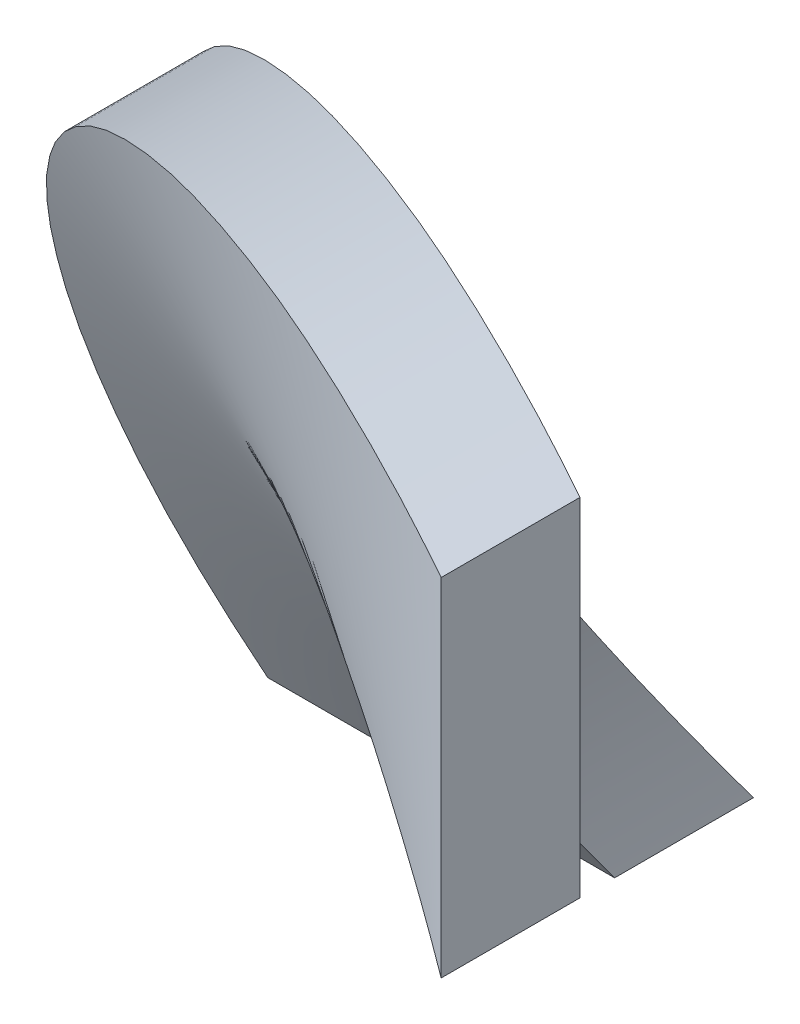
from build123d import *

# Parameters (mm, degrees)
T_HNOUT_PO_K_IVCE3_PITCH       = 70
T_HNOUT_PO_K_IVCE3_HEIGHT      = 210
T_HNOUT_PO_K_IVCE3_RADIUS      = 17.5
T_HNOUT_PO_K_IVCE3_START_ANGLE = -180
SKICA7_W                       = 5
SKICA7_H                       = 2
M_TKO1_SCALE                   = 0.655
ODEBRAT_VYSUNUT_M1_DEPTH       = 140.441178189
SKICA10_R                      = 64.484170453
ODEBRAT_VYSUNUT_M2_DEPTH       = 200


with BuildPart() as part:
    # T_hnout po k_ivce3: sweep along a helix
    with BuildLine() as t_hnout_po_k_ivce3_path:
        add(Helix(T_HNOUT_PO_K_IVCE3_PITCH, T_HNOUT_PO_K_IVCE3_HEIGHT, T_HNOUT_PO_K_IVCE3_RADIUS, center=(0, 0, 0), direction=(0, 0, 1), lefthand=True, mode=Mode.PRIVATE).rotate(Axis((0, 0, 0), (0, 0, 1)), T_HNOUT_PO_K_IVCE3_START_ANGLE))
    # Skica7 → T_hnout po k_ivce3 (sweep)
    with BuildSketch(Plane(origin=(-17.5, 0, 0), x_dir=(-1, 0, 0), z_dir=(0, -1, 0))):
        Rectangle(SKICA7_W, SKICA7_H)
    sweep(path=t_hnout_po_k_ivce3_path.line, is_frenet=True)


with BuildPart() as part_1:
    # M_tko1: scaled about (0, 0, 0)
    add(part.part.scale(M_TKO1_SCALE))

    # Skica8 → Odebrat vysunut_m1 (cut, through all)
    with BuildSketch(Plane.XY):
        with BuildLine():
            Line((0, 29.81130579), (0, 0))
            Line((0, 0), (26.562067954, -13.534049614))
            ThreePointArc((26.562067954, -13.534049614), (28.987617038, -6.959311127), (29.81130579, 0))
            ThreePointArc((29.81130579, 0), (21.07977648, 21.07977648), (0, 29.81130579))
        make_face()
    extrude(amount=ODEBRAT_VYSUNUT_M1_DEPTH, mode=Mode.SUBTRACT)


with BuildPart() as odebrat_vysunut_m1_piece_1:
    # of the separate pieces the step leaves, piece 1, a body of its own (odebrat_vysunut_m1_pieces)
    add(part_1.part.solids().sort_by_distance((8.754139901, -4.460457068, 27.018749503))[0])


with BuildPart() as odebrat_vysunut_m1_piece_2:
    # of the separate pieces the step leaves, piece 2, a body of its own (odebrat_vysunut_m1_pieces)
    add(part_1.part.solids().sort_by_distance((8.754140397, -4.460457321, 72.868749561))[0])


with BuildPart() as odebrat_vysunut_m1_piece_3:
    # of the separate pieces the step leaves, piece 3, a body of its own (odebrat_vysunut_m1_pieces)
    add(part_1.part.solids().sort_by_distance((8.754138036, -4.460456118, 118.718747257))[0])


with BuildPart() as odebrat_vysunut_m1_piece_4:
    # of the separate pieces the step leaves, piece 4, a body of its own (odebrat_vysunut_m1_pieces)
    add(part_1.part.solids().sort_by_distance((-9.825, 0, 0.655))[0])


with BuildPart() as odebrat_vysunut_m2_tool:
    # Skica10 → Odebrat vysunut_m2 (new body)
    with BuildSketch(Plane.XY.offset(20)):
        Circle(SKICA10_R)
    extrude(amount=ODEBRAT_VYSUNUT_M2_DEPTH)


with BuildPart() as odebrat_vysunut_m1_piece_1_1:
    add(odebrat_vysunut_m1_piece_1.part)

    # Odebrat vysunut_m2: cut by odebrat_vysunut_m2_tool
    add(odebrat_vysunut_m2_tool.part, mode=Mode.SUBTRACT)


with BuildPart() as odebrat_vysunut_m1_piece_2_1:
    add(odebrat_vysunut_m1_piece_2.part)

    # Odebrat vysunut_m2: cut by odebrat_vysunut_m2_tool
    add(odebrat_vysunut_m2_tool.part, mode=Mode.SUBTRACT)


with BuildPart() as odebrat_vysunut_m1_piece_3_1:
    add(odebrat_vysunut_m1_piece_3.part)

    # Odebrat vysunut_m2: cut by odebrat_vysunut_m2_tool
    add(odebrat_vysunut_m2_tool.part, mode=Mode.SUBTRACT)


solid = odebrat_vysunut_m1_piece_4.part
